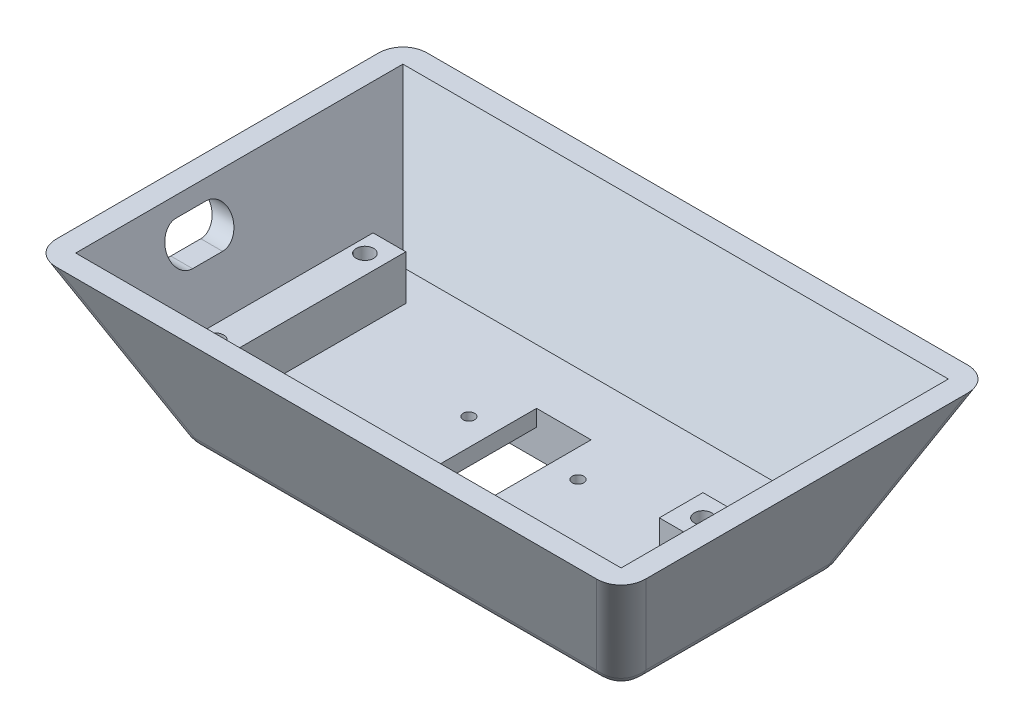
ISO-10303-21;
HEADER;
FILE_DESCRIPTION(('STEP AP214'),'2;1');
FILE_NAME('part.step','',(''),(''),'','','');
FILE_SCHEMA(('AUTOMOTIVE_DESIGN { 1 0 10303 214 1 1 1 1 }'));
ENDSEC;
DATA;
#1=APPLICATION_CONTEXT('core data for automotive mechanical design processes');
#2=APPLICATION_PROTOCOL_DEFINITION('international standard','automotive_design',2000,#1);
#3=PRODUCT_CONTEXT('',#1,'mechanical');
#4=PRODUCT('Part','Part','',(#3));
#5=PRODUCT_RELATED_PRODUCT_CATEGORY('part','',(#4));
#6=PRODUCT_DEFINITION_FORMATION('','',#4);
#7=PRODUCT_DEFINITION_CONTEXT('part definition',#1,'design');
#8=PRODUCT_DEFINITION('design','',#6,#7);
#9=PRODUCT_DEFINITION_SHAPE('','',#8);
#10=(LENGTH_UNIT() NAMED_UNIT(*) SI_UNIT(.MILLI.,.METRE.));
#11=(NAMED_UNIT(*) PLANE_ANGLE_UNIT() SI_UNIT($,.RADIAN.));
#12=(NAMED_UNIT(*) SI_UNIT($,.STERADIAN.) SOLID_ANGLE_UNIT());
#13=UNCERTAINTY_MEASURE_WITH_UNIT(LENGTH_MEASURE(1.E-05),#10,'distance_accuracy_value','');
#14=(GEOMETRIC_REPRESENTATION_CONTEXT(3) GLOBAL_UNCERTAINTY_ASSIGNED_CONTEXT((#13)) GLOBAL_UNIT_ASSIGNED_CONTEXT((#10,
#11,#12)) REPRESENTATION_CONTEXT('',''));
#15=CARTESIAN_POINT('',(0.,0.,0.));
#16=DIRECTION('',(0.,0.,1.));
#17=DIRECTION('',(1.,0.,0.));
#18=AXIS2_PLACEMENT_3D('',#15,#16,#17);
#19=CARTESIAN_POINT('',(0.,8.,0.));
#20=DIRECTION('',(0.,1.,0.));
#21=DIRECTION('',(0.,0.,1.));
#22=AXIS2_PLACEMENT_3D('',#19,#20,#21);
#23=PLANE('',#22);
#24=CARTESIAN_POINT('',(-10.,8.,-2.1));
#25=DIRECTION('',(0.,1.,0.));
#26=DIRECTION('',(0.,0.,1.));
#27=AXIS2_PLACEMENT_3D('',#24,#25,#26);
#28=CIRCLE('',#27,1.05);
#29=CARTESIAN_POINT('',(-10.,8.,-1.05));
#30=VERTEX_POINT('',#29);
#31=EDGE_CURVE('E385',#30,#30,#28,.F.);
#32=ORIENTED_EDGE('',*,*,#31,.T.);
#33=EDGE_LOOP('',(#32));
#34=FACE_BOUND('',#33,.T.);
#35=DIRECTION('',(0.,0.,-1.));
#36=VECTOR('',#35,1.);
#37=CARTESIAN_POINT('',(-5.1,8.,9.6));
#38=LINE('',#37,#36);
#39=CARTESIAN_POINT('',(-5.1,8.,9.6));
#40=VERTEX_POINT('',#39);
#41=CARTESIAN_POINT('',(-5.1,8.,-9.6));
#42=VERTEX_POINT('',#41);
#43=EDGE_CURVE('E407',#40,#42,#38,.T.);
#44=ORIENTED_EDGE('',*,*,#43,.T.);
#45=DIRECTION('',(1.,0.,0.));
#46=VECTOR('',#45,1.);
#47=CARTESIAN_POINT('',(4.9,8.,-9.6));
#48=LINE('',#47,#46);
#49=CARTESIAN_POINT('',(4.9,8.,-9.6));
#50=VERTEX_POINT('',#49);
#51=EDGE_CURVE('E389',#42,#50,#48,.T.);
#52=ORIENTED_EDGE('',*,*,#51,.T.);
#53=DIRECTION('',(0.,0.,1.));
#54=VECTOR('',#53,1.);
#55=CARTESIAN_POINT('',(4.9,8.,9.6));
#56=LINE('',#55,#54);
#57=CARTESIAN_POINT('',(4.9,8.,9.6));
#58=VERTEX_POINT('',#57);
#59=EDGE_CURVE('E388',#50,#58,#56,.T.);
#60=ORIENTED_EDGE('',*,*,#59,.T.);
#61=DIRECTION('',(-1.,0.,0.));
#62=VECTOR('',#61,1.);
#63=CARTESIAN_POINT('',(4.9,8.,9.6));
#64=LINE('',#63,#62);
#65=EDGE_CURVE('E410',#58,#40,#64,.T.);
#66=ORIENTED_EDGE('',*,*,#65,.T.);
#67=EDGE_LOOP('',(#44,#52,#60,#66));
#68=FACE_BOUND('',#67,.T.);
#69=CARTESIAN_POINT('',(10.,8.,-2.1));
#70=DIRECTION('',(0.,1.,0.));
#71=DIRECTION('',(0.,0.,1.));
#72=AXIS2_PLACEMENT_3D('',#69,#70,#71);
#73=CIRCLE('',#72,1.05);
#74=CARTESIAN_POINT('',(10.,8.,-1.05));
#75=VERTEX_POINT('',#74);
#76=EDGE_CURVE('E393',#75,#75,#73,.F.);
#77=ORIENTED_EDGE('',*,*,#76,.T.);
#78=EDGE_LOOP('',(#77));
#79=FACE_BOUND('',#78,.T.);
#80=DIRECTION('',(1.,0.,0.));
#81=VECTOR('',#80,1.);
#82=CARTESIAN_POINT('',(0.,8.,-3.26953873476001));
#83=LINE('',#82,#81);
#84=CARTESIAN_POINT('',(31.73046126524,8.,-3.26953873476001));
#85=VERTEX_POINT('',#84);
#86=CARTESIAN_POINT('',(39.73046126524,8.,-3.26953873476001));
#87=VERTEX_POINT('',#86);
#88=EDGE_CURVE('E320',#85,#87,#83,.T.);
#89=ORIENTED_EDGE('',*,*,#88,.T.);
#90=DIRECTION('',(0.,0.,-1.));
#91=VECTOR('',#90,1.);
#92=CARTESIAN_POINT('',(39.73046126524,8.,0.));
#93=LINE('',#92,#91);
#94=CARTESIAN_POINT('',(39.73046126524,8.,-19.73046126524));
#95=VERTEX_POINT('',#94);
#96=EDGE_CURVE('E446',#87,#95,#93,.T.);
#97=ORIENTED_EDGE('',*,*,#96,.T.);
#98=DIRECTION('',(-1.,0.,0.));
#99=VECTOR('',#98,1.);
#100=CARTESIAN_POINT('',(0.,8.,-19.73046126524));
#101=LINE('',#100,#99);
#102=CARTESIAN_POINT('',(-39.73046126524,8.,-19.73046126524));
#103=VERTEX_POINT('',#102);
#104=EDGE_CURVE('E429',#95,#103,#101,.T.);
#105=ORIENTED_EDGE('',*,*,#104,.T.);
#106=DIRECTION('',(0.,0.,1.));
#107=VECTOR('',#106,1.);
#108=CARTESIAN_POINT('',(-39.73046126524,8.,0.));
#109=LINE('',#108,#107);
#110=CARTESIAN_POINT('',(-39.73046126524,8.,-14.26953873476));
#111=VERTEX_POINT('',#110);
#112=EDGE_CURVE('E443',#103,#111,#109,.T.);
#113=ORIENTED_EDGE('',*,*,#112,.T.);
#114=DIRECTION('',(1.,0.,0.));
#115=VECTOR('',#114,1.);
#116=CARTESIAN_POINT('',(0.,8.,-14.26953873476));
#117=LINE('',#116,#115);
#118=CARTESIAN_POINT('',(-33.73046126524,8.,-14.26953873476));
#119=VERTEX_POINT('',#118);
#120=EDGE_CURVE('E354',#111,#119,#117,.T.);
#121=ORIENTED_EDGE('',*,*,#120,.T.);
#122=DIRECTION('',(0.,0.,1.));
#123=VECTOR('',#122,1.);
#124=CARTESIAN_POINT('',(-33.73046126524,8.,0.));
#125=LINE('',#124,#123);
#126=CARTESIAN_POINT('',(-33.73046126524,8.,19.73046126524));
#127=VERTEX_POINT('',#126);
#128=EDGE_CURVE('E349',#119,#127,#125,.T.);
#129=ORIENTED_EDGE('',*,*,#128,.T.);
#130=DIRECTION('',(1.,0.,0.));
#131=VECTOR('',#130,1.);
#132=CARTESIAN_POINT('',(0.,8.,19.73046126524));
#133=LINE('',#132,#131);
#134=CARTESIAN_POINT('',(39.73046126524,8.,19.73046126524));
#135=VERTEX_POINT('',#134);
#136=EDGE_CURVE('E450',#127,#135,#133,.T.);
#137=ORIENTED_EDGE('',*,*,#136,.T.);
#138=CARTESIAN_POINT('',(39.73046126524,8.,4.73046126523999));
#139=VERTEX_POINT('',#138);
#140=EDGE_CURVE('E438',#135,#139,#93,.T.);
#141=ORIENTED_EDGE('',*,*,#140,.T.);
#142=DIRECTION('',(-1.,0.,0.));
#143=VECTOR('',#142,1.);
#144=CARTESIAN_POINT('',(0.,8.,4.73046126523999));
#145=LINE('',#144,#143);
#146=CARTESIAN_POINT('',(31.73046126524,8.,4.73046126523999));
#147=VERTEX_POINT('',#146);
#148=EDGE_CURVE('E326',#139,#147,#145,.T.);
#149=ORIENTED_EDGE('',*,*,#148,.T.);
#150=DIRECTION('',(0.,0.,-1.));
#151=VECTOR('',#150,1.);
#152=CARTESIAN_POINT('',(31.73046126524,8.,0.));
#153=LINE('',#152,#151);
#154=EDGE_CURVE('E323',#147,#85,#153,.T.);
#155=ORIENTED_EDGE('',*,*,#154,.T.);
#156=EDGE_LOOP('',(#89,#97,#105,#113,#121,#129,#137,#141,#149,#155));
#157=FACE_BOUND('',#156,.T.);
#158=ADVANCED_FACE('F43',(#34,#68,#79,#157),#23,.T.);
#159=CARTESIAN_POINT('',(0.,5.,0.));
#160=DIRECTION('',(0.,-1.,0.));
#161=DIRECTION('',(0.,0.,-1.));
#162=AXIS2_PLACEMENT_3D('',#159,#160,#161);
#163=PLANE('',#162);
#164=DIRECTION('',(0.,0.,-1.));
#165=VECTOR('',#164,1.);
#166=CARTESIAN_POINT('',(-5.1,5.,9.6));
#167=LINE('',#166,#165);
#168=CARTESIAN_POINT('',(-5.1,5.,9.6));
#169=VERTEX_POINT('',#168);
#170=CARTESIAN_POINT('',(-5.1,5.,-9.6));
#171=VERTEX_POINT('',#170);
#172=EDGE_CURVE('E404',#169,#171,#167,.T.);
#173=ORIENTED_EDGE('',*,*,#172,.F.);
#174=DIRECTION('',(-1.,0.,0.));
#175=VECTOR('',#174,1.);
#176=CARTESIAN_POINT('',(-15.1,5.,9.6));
#177=LINE('',#176,#175);
#178=CARTESIAN_POINT('',(-15.1,5.,9.6));
#179=VERTEX_POINT('',#178);
#180=EDGE_CURVE('E456',#169,#179,#177,.T.);
#181=ORIENTED_EDGE('',*,*,#180,.T.);
#182=DIRECTION('',(0.,0.,-1.));
#183=VECTOR('',#182,1.);
#184=CARTESIAN_POINT('',(-15.1,5.,9.6));
#185=LINE('',#184,#183);
#186=CARTESIAN_POINT('',(-15.1,5.,-9.6));
#187=VERTEX_POINT('',#186);
#188=EDGE_CURVE('E461',#179,#187,#185,.T.);
#189=ORIENTED_EDGE('',*,*,#188,.T.);
#190=DIRECTION('',(1.,0.,0.));
#191=VECTOR('',#190,1.);
#192=CARTESIAN_POINT('',(-15.1,5.,-9.6));
#193=LINE('',#192,#191);
#194=EDGE_CURVE('E465',#187,#171,#193,.T.);
#195=ORIENTED_EDGE('',*,*,#194,.T.);
#196=EDGE_LOOP('',(#173,#181,#189,#195));
#197=FACE_BOUND('',#196,.T.);
#198=CARTESIAN_POINT('',(-10.,5.,-2.1));
#199=DIRECTION('',(0.,-1.,0.));
#200=DIRECTION('',(0.,0.,-1.));
#201=AXIS2_PLACEMENT_3D('',#198,#199,#200);
#202=CIRCLE('',#201,1.05);
#203=CARTESIAN_POINT('',(-10.,5.,-3.15));
#204=VERTEX_POINT('',#203);
#205=EDGE_CURVE('E381',#204,#204,#202,.T.);
#206=ORIENTED_EDGE('',*,*,#205,.F.);
#207=EDGE_LOOP('',(#206));
#208=FACE_BOUND('',#207,.T.);
#209=ADVANCED_FACE('F650',(#197,#208),#163,.T.);
#210=CARTESIAN_POINT('',(40.,0.,-20.));
#211=DIRECTION('',(0.90630778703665,-0.4226182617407,0.));
#212=DIRECTION('',(0.4226182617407,0.90630778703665,0.));
#213=AXIS2_PLACEMENT_3D('',#210,#211,#212);
#214=PLANE('',#213);
#215=DIRECTION('',(0.,0.,1.));
#216=VECTOR('',#215,1.);
#217=CARTESIAN_POINT('',(53.98922974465,30.,-20.));
#218=LINE('',#217,#216);
#219=CARTESIAN_POINT('',(53.98922974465,30.,29.4576908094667));
#220=VERTEX_POINT('',#219);
#221=CARTESIAN_POINT('',(53.98922974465,30.,-29.4576908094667));
#222=VERTEX_POINT('',#221);
#223=EDGE_CURVE('E480',#220,#222,#218,.F.);
#224=ORIENTED_EDGE('',*,*,#223,.F.);
#225=DIRECTION('',(0.389281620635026,0.834817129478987,0.389281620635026));
#226=VECTOR('',#225,1.);
#227=CARTESIAN_POINT('',(34.6251030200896,-11.5265037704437,10.0935640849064));
#228=LINE('',#227,#226);
#229=CARTESIAN_POINT('',(41.3461876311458,2.8869086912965,16.8146486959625));
#230=VERTEX_POINT('',#229);
#231=EDGE_CURVE('E533',#220,#230,#228,.F.);
#232=ORIENTED_EDGE('',*,*,#231,.T.);
#233=DIRECTION('',(0.,0.,-1.));
#234=VECTOR('',#233,1.);
#235=CARTESIAN_POINT('',(41.3461876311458,2.8869086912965,-20.));
#236=LINE('',#235,#234);
#237=CARTESIAN_POINT('',(41.3461876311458,2.8869086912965,-16.8146486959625));
#238=VERTEX_POINT('',#237);
#239=EDGE_CURVE('E531',#230,#238,#236,.T.);
#240=ORIENTED_EDGE('',*,*,#239,.T.);
#241=DIRECTION('',(0.389281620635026,0.834817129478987,-0.389281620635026));
#242=VECTOR('',#241,1.);
#243=CARTESIAN_POINT('',(40.6867102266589,1.4726548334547,-16.1551712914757));
#244=LINE('',#243,#242);
#245=EDGE_CURVE('E529',#238,#222,#244,.T.);
#246=ORIENTED_EDGE('',*,*,#245,.T.);
#247=EDGE_LOOP('',(#224,#232,#240,#246));
#248=FACE_BOUND('',#247,.T.);
#249=ADVANCED_FACE('F613',(#248),#214,.T.);
#250=CARTESIAN_POINT('',(-40.,0.,-20.));
#251=DIRECTION('',(0.,-0.4226182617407,-0.90630778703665));
#252=DIRECTION('',(0.,0.90630778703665,-0.4226182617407));
#253=AXIS2_PLACEMENT_3D('',#250,#251,#252);
#254=PLANE('',#253);
#255=DIRECTION('',(1.,0.,0.));
#256=VECTOR('',#255,1.);
#257=CARTESIAN_POINT('',(-40.,30.,-33.98922974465));
#258=LINE('',#257,#256);
#259=CARTESIAN_POINT('',(49.4576908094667,30.,-33.98922974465));
#260=VERTEX_POINT('',#259);
#261=CARTESIAN_POINT('',(-49.4576908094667,30.,-33.98922974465));
#262=VERTEX_POINT('',#261);
#263=EDGE_CURVE('E489',#260,#262,#258,.F.);
#264=ORIENTED_EDGE('',*,*,#263,.F.);
#265=DIRECTION('',(0.389281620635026,0.834817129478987,-0.389281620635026));
#266=VECTOR('',#265,1.);
#267=CARTESIAN_POINT('',(24.0319568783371,-24.5256623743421,-8.56349581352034));
#268=LINE('',#267,#266);
#269=CARTESIAN_POINT('',(36.8146486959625,2.8869086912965,-21.3461876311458));
#270=VERTEX_POINT('',#269);
#271=EDGE_CURVE('E60',#260,#270,#268,.F.);
#272=ORIENTED_EDGE('',*,*,#271,.T.);
#273=DIRECTION('',(-1.,0.,0.));
#274=VECTOR('',#273,1.);
#275=CARTESIAN_POINT('',(-40.,2.8869086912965,-21.3461876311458));
#276=LINE('',#275,#274);
#277=CARTESIAN_POINT('',(-36.8146486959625,2.8869086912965,-21.3461876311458));
#278=VERTEX_POINT('',#277);
#279=EDGE_CURVE('E65',#270,#278,#276,.T.);
#280=ORIENTED_EDGE('',*,*,#279,.T.);
#281=DIRECTION('',(-0.389281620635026,0.834817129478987,-0.389281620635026));
#282=VECTOR('',#281,1.);
#283=CARTESIAN_POINT('',(-36.1551712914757,1.4726548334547,-20.6867102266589));
#284=LINE('',#283,#282);
#285=EDGE_CURVE('E535',#278,#262,#284,.T.);
#286=ORIENTED_EDGE('',*,*,#285,.T.);
#287=EDGE_LOOP('',(#264,#272,#280,#286));
#288=FACE_BOUND('',#287,.T.);
#289=ADVANCED_FACE('F607',(#288),#254,.T.);
#290=CARTESIAN_POINT('',(-40.,0.,-20.));
#291=DIRECTION('',(-0.90630778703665,-0.4226182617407,0.));
#292=DIRECTION('',(0.4226182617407,-0.90630778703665,0.));
#293=AXIS2_PLACEMENT_3D('',#290,#291,#292);
#294=PLANE('',#293);
#295=DIRECTION('',(0.,0.,1.));
#296=VECTOR('',#295,1.);
#297=CARTESIAN_POINT('',(-52.8234605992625,27.5,12.75));
#298=LINE('',#297,#296);
#299=CARTESIAN_POINT('',(-52.8234605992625,27.5,12.75));
#300=VERTEX_POINT('',#299);
#301=CARTESIAN_POINT('',(-52.8234605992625,27.5,7.25000000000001));
#302=VERTEX_POINT('',#301);
#303=EDGE_CURVE('E297',#300,#302,#298,.F.);
#304=ORIENTED_EDGE('',*,*,#303,.F.);
#305=CARTESIAN_POINT('',(-51.3079607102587,24.25,12.75));
#306=DIRECTION('',(-0.90630778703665,-0.4226182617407,0.));
#307=DIRECTION('',(0.4226182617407,-0.90630778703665,0.));
#308=AXIS2_PLACEMENT_3D('',#305,#306,#307);
#309=ELLIPSE('',#308,3.5859782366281,3.25);
#310=CARTESIAN_POINT('',(-49.792460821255,21.,12.75));
#311=VERTEX_POINT('',#310);
#312=EDGE_CURVE('E300',#311,#300,#309,.T.);
#313=ORIENTED_EDGE('',*,*,#312,.F.);
#314=DIRECTION('',(0.,0.,-1.));
#315=VECTOR('',#314,1.);
#316=CARTESIAN_POINT('',(-49.792460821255,21.,12.75));
#317=LINE('',#316,#315);
#318=CARTESIAN_POINT('',(-49.792460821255,21.,7.25000000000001));
#319=VERTEX_POINT('',#318);
#320=EDGE_CURVE('E282',#319,#311,#317,.F.);
#321=ORIENTED_EDGE('',*,*,#320,.F.);
#322=CARTESIAN_POINT('',(-51.3079607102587,24.25,7.25000000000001));
#323=DIRECTION('',(-0.90630778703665,-0.4226182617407,0.));
#324=DIRECTION('',(0.4226182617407,-0.90630778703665,0.));
#325=AXIS2_PLACEMENT_3D('',#322,#323,#324);
#326=ELLIPSE('',#325,3.5859782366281,3.25);
#327=EDGE_CURVE('E269',#302,#319,#326,.T.);
#328=ORIENTED_EDGE('',*,*,#327,.F.);
#329=EDGE_LOOP('',(#304,#313,#321,#328));
#330=FACE_BOUND('',#329,.T.);
#331=DIRECTION('',(0.,0.,1.));
#332=VECTOR('',#331,1.);
#333=CARTESIAN_POINT('',(-41.3461876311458,2.8869086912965,-20.));
#334=LINE('',#333,#332);
#335=CARTESIAN_POINT('',(-41.3461876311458,2.8869086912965,-16.8146486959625));
#336=VERTEX_POINT('',#335);
#337=CARTESIAN_POINT('',(-41.3461876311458,2.8869086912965,16.8146486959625));
#338=VERTEX_POINT('',#337);
#339=EDGE_CURVE('E509',#336,#338,#334,.T.);
#340=ORIENTED_EDGE('',*,*,#339,.T.);
#341=DIRECTION('',(-0.389281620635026,0.834817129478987,0.389281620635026));
#342=VECTOR('',#341,1.);
#343=CARTESIAN_POINT('',(-34.6251030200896,-11.5265037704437,10.0935640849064));
#344=LINE('',#343,#342);
#345=CARTESIAN_POINT('',(-53.98922974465,30.,29.4576908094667));
#346=VERTEX_POINT('',#345);
#347=EDGE_CURVE('E512',#338,#346,#344,.T.);
#348=ORIENTED_EDGE('',*,*,#347,.T.);
#349=DIRECTION('',(0.,0.,-1.));
#350=VECTOR('',#349,1.);
#351=CARTESIAN_POINT('',(-53.98922974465,30.,-20.));
#352=LINE('',#351,#350);
#353=CARTESIAN_POINT('',(-53.98922974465,30.,-29.4576908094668));
#354=VERTEX_POINT('',#353);
#355=EDGE_CURVE('E492',#354,#346,#352,.F.);
#356=ORIENTED_EDGE('',*,*,#355,.F.);
#357=DIRECTION('',(-0.389281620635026,0.834817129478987,-0.389281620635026));
#358=VECTOR('',#357,1.);
#359=CARTESIAN_POINT('',(-40.6867102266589,1.4726548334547,-16.1551712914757));
#360=LINE('',#359,#358);
#361=EDGE_CURVE('E507',#354,#336,#360,.F.);
#362=ORIENTED_EDGE('',*,*,#361,.T.);
#363=EDGE_LOOP('',(#340,#348,#356,#362));
#364=FACE_BOUND('',#363,.T.);
#365=ADVANCED_FACE('F634',(#330,#364),#294,.T.);
#366=CARTESIAN_POINT('',(-40.,0.,20.));
#367=DIRECTION('',(0.,-0.4226182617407,0.90630778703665));
#368=DIRECTION('',(0.,-0.90630778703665,-0.4226182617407));
#369=AXIS2_PLACEMENT_3D('',#366,#367,#368);
#370=PLANE('',#369);
#371=DIRECTION('',(-1.,0.,0.));
#372=VECTOR('',#371,1.);
#373=CARTESIAN_POINT('',(-40.,30.,33.98922974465));
#374=LINE('',#373,#372);
#375=CARTESIAN_POINT('',(-49.4576908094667,30.,33.98922974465));
#376=VERTEX_POINT('',#375);
#377=CARTESIAN_POINT('',(49.4576908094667,30.,33.98922974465));
#378=VERTEX_POINT('',#377);
#379=EDGE_CURVE('E495',#376,#378,#374,.F.);
#380=ORIENTED_EDGE('',*,*,#379,.F.);
#381=DIRECTION('',(-0.389281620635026,0.834817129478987,0.389281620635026));
#382=VECTOR('',#381,1.);
#383=CARTESIAN_POINT('',(-36.1551712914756,1.4726548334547,20.6867102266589));
#384=LINE('',#383,#382);
#385=CARTESIAN_POINT('',(-36.8146486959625,2.8869086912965,21.3461876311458));
#386=VERTEX_POINT('',#385);
#387=EDGE_CURVE('E527',#376,#386,#384,.F.);
#388=ORIENTED_EDGE('',*,*,#387,.T.);
#389=DIRECTION('',(1.,0.,0.));
#390=VECTOR('',#389,1.);
#391=CARTESIAN_POINT('',(-40.,2.8869086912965,21.3461876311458));
#392=LINE('',#391,#390);
#393=CARTESIAN_POINT('',(36.8146486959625,2.8869086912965,21.3461876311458));
#394=VERTEX_POINT('',#393);
#395=EDGE_CURVE('E525',#386,#394,#392,.T.);
#396=ORIENTED_EDGE('',*,*,#395,.T.);
#397=DIRECTION('',(0.389281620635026,0.834817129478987,0.389281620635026));
#398=VECTOR('',#397,1.);
#399=CARTESIAN_POINT('',(24.0319568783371,-24.5256623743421,8.56349581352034));
#400=LINE('',#399,#398);
#401=EDGE_CURVE('E523',#394,#378,#400,.T.);
#402=ORIENTED_EDGE('',*,*,#401,.T.);
#403=EDGE_LOOP('',(#380,#388,#396,#402));
#404=FACE_BOUND('',#403,.T.);
#405=ADVANCED_FACE('F637',(#404),#370,.T.);
#406=CARTESIAN_POINT('',(0.,30.,0.));
#407=DIRECTION('',(0.,1.,0.));
#408=DIRECTION('',(0.,0.,1.));
#409=AXIS2_PLACEMENT_3D('',#406,#407,#408);
#410=PLANE('',#409);
#411=DIRECTION('',(-1.,0.,0.));
#412=VECTOR('',#411,1.);
#413=CARTESIAN_POINT('',(49.98922974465,30.,-29.98922974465));
#414=LINE('',#413,#412);
#415=CARTESIAN_POINT('',(49.98922974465,30.,-29.98922974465));
#416=VERTEX_POINT('',#415);
#417=CARTESIAN_POINT('',(-49.98922974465,30.,-29.98922974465));
#418=VERTEX_POINT('',#417);
#419=EDGE_CURVE('E384',#416,#418,#414,.T.);
#420=ORIENTED_EDGE('',*,*,#419,.F.);
#421=DIRECTION('',(0.,0.,-1.));
#422=VECTOR('',#421,1.);
#423=CARTESIAN_POINT('',(49.98922974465,30.,29.98922974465));
#424=LINE('',#423,#422);
#425=CARTESIAN_POINT('',(49.98922974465,30.,29.98922974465));
#426=VERTEX_POINT('',#425);
#427=EDGE_CURVE('E426',#426,#416,#424,.T.);
#428=ORIENTED_EDGE('',*,*,#427,.F.);
#429=DIRECTION('',(1.,0.,0.));
#430=VECTOR('',#429,1.);
#431=CARTESIAN_POINT('',(-49.98922974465,30.,29.98922974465));
#432=LINE('',#431,#430);
#433=CARTESIAN_POINT('',(-49.98922974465,30.,29.98922974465));
#434=VERTEX_POINT('',#433);
#435=EDGE_CURVE('E423',#434,#426,#432,.T.);
#436=ORIENTED_EDGE('',*,*,#435,.F.);
#437=DIRECTION('',(0.,0.,1.));
#438=VECTOR('',#437,1.);
#439=CARTESIAN_POINT('',(-49.98922974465,30.,-29.98922974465));
#440=LINE('',#439,#438);
#441=EDGE_CURVE('E420',#418,#434,#440,.T.);
#442=ORIENTED_EDGE('',*,*,#441,.F.);
#443=EDGE_LOOP('',(#420,#428,#436,#442));
#444=FACE_BOUND('',#443,.T.);
#445=ORIENTED_EDGE('',*,*,#355,.T.);
#446=CARTESIAN_POINT('',(-48.4723401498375,30.,28.4723401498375));
#447=DIRECTION('',(0.,1.,0.));
#448=DIRECTION('',(0.707106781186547,0.,-0.707106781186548));
#449=AXIS2_PLACEMENT_3D('',#446,#447,#448);
#450=ELLIPSE('',#449,5.98933565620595,5.);
#451=EDGE_CURVE('E11',#346,#376,#450,.T.);
#452=ORIENTED_EDGE('',*,*,#451,.T.);
#453=ORIENTED_EDGE('',*,*,#379,.T.);
#454=CARTESIAN_POINT('',(48.4723401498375,30.,28.4723401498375));
#455=DIRECTION('',(0.,1.,0.));
#456=DIRECTION('',(-0.707106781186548,0.,-0.707106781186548));
#457=AXIS2_PLACEMENT_3D('',#454,#455,#456);
#458=ELLIPSE('',#457,5.98933565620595,5.);
#459=EDGE_CURVE('E52',#378,#220,#458,.T.);
#460=ORIENTED_EDGE('',*,*,#459,.T.);
#461=ORIENTED_EDGE('',*,*,#223,.T.);
#462=CARTESIAN_POINT('',(48.4723401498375,30.,-28.4723401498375));
#463=DIRECTION('',(0.,1.,0.));
#464=DIRECTION('',(-0.707106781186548,0.,0.707106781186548));
#465=AXIS2_PLACEMENT_3D('',#462,#463,#464);
#466=ELLIPSE('',#465,5.98933565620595,5.);
#467=EDGE_CURVE('E541',#222,#260,#466,.T.);
#468=ORIENTED_EDGE('',*,*,#467,.T.);
#469=ORIENTED_EDGE('',*,*,#263,.T.);
#470=CARTESIAN_POINT('',(-48.4723401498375,30.,-28.4723401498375));
#471=DIRECTION('',(0.,1.,0.));
#472=DIRECTION('',(0.707106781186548,0.,0.707106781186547));
#473=AXIS2_PLACEMENT_3D('',#470,#471,#472);
#474=ELLIPSE('',#473,5.98933565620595,5.);
#475=EDGE_CURVE('E539',#262,#354,#474,.T.);
#476=ORIENTED_EDGE('',*,*,#475,.T.);
#477=EDGE_LOOP('',(#445,#452,#453,#460,#461,#468,#469,#476));
#478=FACE_BOUND('',#477,.T.);
#479=ADVANCED_FACE('F609',(#444,#478),#410,.T.);
#480=CARTESIAN_POINT('',(0.,0.,0.));
#481=DIRECTION('',(0.,1.,0.));
#482=DIRECTION('',(0.,0.,1.));
#483=AXIS2_PLACEMENT_3D('',#480,#481,#482);
#484=PLANE('',#483);
#485=DIRECTION('',(-1.,0.,0.));
#486=VECTOR('',#485,1.);
#487=CARTESIAN_POINT('',(0.,0.,16.8146486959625));
#488=LINE('',#487,#486);
#489=CARTESIAN_POINT('',(36.8146486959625,0.,16.8146486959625));
#490=VERTEX_POINT('',#489);
#491=CARTESIAN_POINT('',(-36.8146486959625,0.,16.8146486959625));
#492=VERTEX_POINT('',#491);
#493=EDGE_CURVE('E518',#490,#492,#488,.T.);
#494=ORIENTED_EDGE('',*,*,#493,.T.);
#495=DIRECTION('',(0.,0.,-1.));
#496=VECTOR('',#495,1.);
#497=CARTESIAN_POINT('',(-36.8146486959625,0.,0.));
#498=LINE('',#497,#496);
#499=CARTESIAN_POINT('',(-36.8146486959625,0.,-16.8146486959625));
#500=VERTEX_POINT('',#499);
#501=EDGE_CURVE('E520',#492,#500,#498,.T.);
#502=ORIENTED_EDGE('',*,*,#501,.T.);
#503=DIRECTION('',(1.,0.,0.));
#504=VECTOR('',#503,1.);
#505=CARTESIAN_POINT('',(0.,0.,-16.8146486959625));
#506=LINE('',#505,#504);
#507=CARTESIAN_POINT('',(36.8146486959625,0.,-16.8146486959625));
#508=VERTEX_POINT('',#507);
#509=EDGE_CURVE('E514',#500,#508,#506,.T.);
#510=ORIENTED_EDGE('',*,*,#509,.T.);
#511=DIRECTION('',(0.,0.,1.));
#512=VECTOR('',#511,1.);
#513=CARTESIAN_POINT('',(36.8146486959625,0.,0.));
#514=LINE('',#513,#512);
#515=EDGE_CURVE('E516',#508,#490,#514,.T.);
#516=ORIENTED_EDGE('',*,*,#515,.T.);
#517=EDGE_LOOP('',(#494,#502,#510,#516));
#518=FACE_BOUND('',#517,.T.);
#519=DIRECTION('',(-1.,0.,0.));
#520=VECTOR('',#519,1.);
#521=CARTESIAN_POINT('',(-15.1,0.,9.6));
#522=LINE('',#521,#520);
#523=CARTESIAN_POINT('',(15.1,0.,9.6));
#524=VERTEX_POINT('',#523);
#525=CARTESIAN_POINT('',(-15.1,0.,9.6));
#526=VERTEX_POINT('',#525);
#527=EDGE_CURVE('E470',#524,#526,#522,.T.);
#528=ORIENTED_EDGE('',*,*,#527,.F.);
#529=DIRECTION('',(0.,0.,1.));
#530=VECTOR('',#529,1.);
#531=CARTESIAN_POINT('',(15.1,0.,9.6));
#532=LINE('',#531,#530);
#533=CARTESIAN_POINT('',(15.1,0.,-9.6));
#534=VERTEX_POINT('',#533);
#535=EDGE_CURVE('E432',#534,#524,#532,.T.);
#536=ORIENTED_EDGE('',*,*,#535,.F.);
#537=DIRECTION('',(1.,0.,0.));
#538=VECTOR('',#537,1.);
#539=CARTESIAN_POINT('',(-15.1,0.,-9.6));
#540=LINE('',#539,#538);
#541=CARTESIAN_POINT('',(-15.1,0.,-9.6));
#542=VERTEX_POINT('',#541);
#543=EDGE_CURVE('E457',#542,#534,#540,.T.);
#544=ORIENTED_EDGE('',*,*,#543,.F.);
#545=DIRECTION('',(0.,0.,-1.));
#546=VECTOR('',#545,1.);
#547=CARTESIAN_POINT('',(-15.1,0.,9.6));
#548=LINE('',#547,#546);
#549=EDGE_CURVE('E473',#526,#542,#548,.T.);
#550=ORIENTED_EDGE('',*,*,#549,.F.);
#551=EDGE_LOOP('',(#528,#536,#544,#550));
#552=FACE_BOUND('',#551,.T.);
#553=ADVANCED_FACE('F589',(#518,#552),#484,.F.);
#554=CARTESIAN_POINT('',(15.1,5.,9.6));
#555=DIRECTION('',(1.,0.,0.));
#556=DIRECTION('',(0.,0.,-1.));
#557=AXIS2_PLACEMENT_3D('',#554,#555,#556);
#558=PLANE('',#557);
#559=ORIENTED_EDGE('',*,*,#535,.T.);
#560=DIRECTION('',(0.,-1.,0.));
#561=VECTOR('',#560,1.);
#562=CARTESIAN_POINT('',(15.1,5.,9.6));
#563=LINE('',#562,#561);
#564=CARTESIAN_POINT('',(15.1,5.,9.6));
#565=VERTEX_POINT('',#564);
#566=EDGE_CURVE('E468',#565,#524,#563,.T.);
#567=ORIENTED_EDGE('',*,*,#566,.F.);
#568=DIRECTION('',(0.,0.,1.));
#569=VECTOR('',#568,1.);
#570=CARTESIAN_POINT('',(15.1,5.,9.6));
#571=LINE('',#570,#569);
#572=CARTESIAN_POINT('',(15.1,5.,-9.6));
#573=VERTEX_POINT('',#572);
#574=EDGE_CURVE('E453',#573,#565,#571,.T.);
#575=ORIENTED_EDGE('',*,*,#574,.F.);
#576=DIRECTION('',(0.,-1.,0.));
#577=VECTOR('',#576,1.);
#578=CARTESIAN_POINT('',(15.1,5.,-9.6));
#579=LINE('',#578,#577);
#580=EDGE_CURVE('E478',#573,#534,#579,.T.);
#581=ORIENTED_EDGE('',*,*,#580,.T.);
#582=EDGE_LOOP('',(#559,#567,#575,#581));
#583=FACE_BOUND('',#582,.T.);
#584=ADVANCED_FACE('F754',(#583),#558,.F.);
#585=CARTESIAN_POINT('',(-15.1,5.,-9.6));
#586=DIRECTION('',(0.,0.,-1.));
#587=DIRECTION('',(-1.,0.,0.));
#588=AXIS2_PLACEMENT_3D('',#585,#586,#587);
#589=PLANE('',#588);
#590=ORIENTED_EDGE('',*,*,#543,.T.);
#591=ORIENTED_EDGE('',*,*,#580,.F.);
#592=CARTESIAN_POINT('',(4.9,5.,-9.6));
#593=VERTEX_POINT('',#592);
#594=EDGE_CURVE('E464',#593,#573,#193,.T.);
#595=ORIENTED_EDGE('',*,*,#594,.F.);
#596=DIRECTION('',(0.,-1.,0.));
#597=VECTOR('',#596,1.);
#598=CARTESIAN_POINT('',(4.9,30.001,-9.6));
#599=LINE('',#598,#597);
#600=EDGE_CURVE('E397',#50,#593,#599,.T.);
#601=ORIENTED_EDGE('',*,*,#600,.F.);
#602=ORIENTED_EDGE('',*,*,#51,.F.);
#603=DIRECTION('',(0.,-1.,0.));
#604=VECTOR('',#603,1.);
#605=CARTESIAN_POINT('',(-5.1,30.001,-9.6));
#606=LINE('',#605,#604);
#607=EDGE_CURVE('E394',#42,#171,#606,.T.);
#608=ORIENTED_EDGE('',*,*,#607,.T.);
#609=ORIENTED_EDGE('',*,*,#194,.F.);
#610=DIRECTION('',(0.,-1.,0.));
#611=VECTOR('',#610,1.);
#612=CARTESIAN_POINT('',(-15.1,5.,-9.6));
#613=LINE('',#612,#611);
#614=EDGE_CURVE('E481',#187,#542,#613,.T.);
#615=ORIENTED_EDGE('',*,*,#614,.T.);
#616=EDGE_LOOP('',(#590,#591,#595,#601,#602,#608,#609,#615));
#617=FACE_BOUND('',#616,.T.);
#618=ADVANCED_FACE('F751',(#617),#589,.F.);
#619=CARTESIAN_POINT('',(-15.1,5.,9.6));
#620=DIRECTION('',(-1.,0.,0.));
#621=DIRECTION('',(0.,0.,1.));
#622=AXIS2_PLACEMENT_3D('',#619,#620,#621);
#623=PLANE('',#622);
#624=ORIENTED_EDGE('',*,*,#549,.T.);
#625=ORIENTED_EDGE('',*,*,#614,.F.);
#626=ORIENTED_EDGE('',*,*,#188,.F.);
#627=DIRECTION('',(0.,-1.,0.));
#628=VECTOR('',#627,1.);
#629=CARTESIAN_POINT('',(-15.1,5.,9.6));
#630=LINE('',#629,#628);
#631=EDGE_CURVE('E483',#179,#526,#630,.T.);
#632=ORIENTED_EDGE('',*,*,#631,.T.);
#633=EDGE_LOOP('',(#624,#625,#626,#632));
#634=FACE_BOUND('',#633,.T.);
#635=ADVANCED_FACE('F744',(#634),#623,.F.);
#636=CARTESIAN_POINT('',(-15.1,5.,9.6));
#637=DIRECTION('',(0.,0.,1.));
#638=DIRECTION('',(1.,0.,0.));
#639=AXIS2_PLACEMENT_3D('',#636,#637,#638);
#640=PLANE('',#639);
#641=ORIENTED_EDGE('',*,*,#527,.T.);
#642=ORIENTED_EDGE('',*,*,#631,.F.);
#643=ORIENTED_EDGE('',*,*,#180,.F.);
#644=DIRECTION('',(0.,-1.,0.));
#645=VECTOR('',#644,1.);
#646=CARTESIAN_POINT('',(-5.1,30.001,9.6));
#647=LINE('',#646,#645);
#648=EDGE_CURVE('E392',#40,#169,#647,.T.);
#649=ORIENTED_EDGE('',*,*,#648,.F.);
#650=ORIENTED_EDGE('',*,*,#65,.F.);
#651=DIRECTION('',(0.,-1.,0.));
#652=VECTOR('',#651,1.);
#653=CARTESIAN_POINT('',(4.9,30.001,9.6));
#654=LINE('',#653,#652);
#655=CARTESIAN_POINT('',(4.9,5.,9.6));
#656=VERTEX_POINT('',#655);
#657=EDGE_CURVE('E399',#58,#656,#654,.T.);
#658=ORIENTED_EDGE('',*,*,#657,.T.);
#659=EDGE_CURVE('E458',#565,#656,#177,.T.);
#660=ORIENTED_EDGE('',*,*,#659,.F.);
#661=ORIENTED_EDGE('',*,*,#566,.T.);
#662=EDGE_LOOP('',(#641,#642,#643,#649,#650,#658,#660,#661));
#663=FACE_BOUND('',#662,.T.);
#664=ADVANCED_FACE('F736',(#663),#640,.F.);
#665=DIRECTION('',(0.,0.,1.));
#666=VECTOR('',#665,1.);
#667=CARTESIAN_POINT('',(4.9,5.,9.6));
#668=LINE('',#667,#666);
#669=EDGE_CURVE('E396',#593,#656,#668,.T.);
#670=ORIENTED_EDGE('',*,*,#669,.F.);
#671=ORIENTED_EDGE('',*,*,#594,.T.);
#672=ORIENTED_EDGE('',*,*,#574,.T.);
#673=ORIENTED_EDGE('',*,*,#659,.T.);
#674=EDGE_LOOP('',(#670,#671,#672,#673));
#675=FACE_BOUND('',#674,.T.);
#676=CARTESIAN_POINT('',(10.,5.,-2.1));
#677=DIRECTION('',(0.,-1.,0.));
#678=DIRECTION('',(0.,0.,1.));
#679=AXIS2_PLACEMENT_3D('',#676,#677,#678);
#680=CIRCLE('',#679,1.05);
#681=CARTESIAN_POINT('',(10.,5.,-1.05));
#682=VERTEX_POINT('',#681);
#683=EDGE_CURVE('E372',#682,#682,#680,.T.);
#684=ORIENTED_EDGE('',*,*,#683,.F.);
#685=EDGE_LOOP('',(#684));
#686=FACE_BOUND('',#685,.T.);
#687=ADVANCED_FACE('F660',(#675,#686),#163,.T.);
#688=CARTESIAN_POINT('',(49.98922974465,30.,-29.98922974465));
#689=DIRECTION('',(0.,-0.4226182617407,-0.90630778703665));
#690=DIRECTION('',(0.,0.90630778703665,-0.4226182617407));
#691=AXIS2_PLACEMENT_3D('',#688,#689,#690);
#692=PLANE('',#691);
#693=ORIENTED_EDGE('',*,*,#419,.T.);
#694=DIRECTION('',(-0.389281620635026,0.834817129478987,-0.389281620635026));
#695=VECTOR('',#694,1.);
#696=CARTESIAN_POINT('',(-34.8384759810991,-2.49089629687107,-14.8384759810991));
#697=LINE('',#696,#695);
#698=EDGE_CURVE('E434',#103,#418,#697,.T.);
#699=ORIENTED_EDGE('',*,*,#698,.F.);
#700=ORIENTED_EDGE('',*,*,#104,.F.);
#701=DIRECTION('',(0.389281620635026,0.834817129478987,-0.389281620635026));
#702=VECTOR('',#701,1.);
#703=CARTESIAN_POINT('',(40.9000831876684,10.5082623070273,-20.9000831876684));
#704=LINE('',#703,#702);
#705=EDGE_CURVE('E430',#95,#416,#704,.T.);
#706=ORIENTED_EDGE('',*,*,#705,.T.);
#707=EDGE_LOOP('',(#693,#699,#700,#706));
#708=FACE_BOUND('',#707,.T.);
#709=ADVANCED_FACE('F735',(#708),#692,.F.);
#710=CARTESIAN_POINT('',(49.98922974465,30.,29.98922974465));
#711=DIRECTION('',(0.90630778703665,-0.4226182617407,0.));
#712=DIRECTION('',(0.4226182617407,0.90630778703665,0.));
#713=AXIS2_PLACEMENT_3D('',#710,#711,#712);
#714=PLANE('',#713);
#715=ORIENTED_EDGE('',*,*,#427,.T.);
#716=ORIENTED_EDGE('',*,*,#705,.F.);
#717=ORIENTED_EDGE('',*,*,#96,.F.);
#718=DIRECTION('',(0.,0.,1.));
#719=VECTOR('',#718,1.);
#720=CARTESIAN_POINT('',(39.73046126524,8.,0.));
#721=LINE('',#720,#719);
#722=EDGE_CURVE('E328',#87,#139,#721,.T.);
#723=ORIENTED_EDGE('',*,*,#722,.T.);
#724=ORIENTED_EDGE('',*,*,#140,.F.);
#725=DIRECTION('',(0.389281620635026,0.834817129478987,0.389281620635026));
#726=VECTOR('',#725,1.);
#727=CARTESIAN_POINT('',(34.8384759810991,-2.49089629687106,14.8384759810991));
#728=LINE('',#727,#726);
#729=EDGE_CURVE('E433',#135,#426,#728,.T.);
#730=ORIENTED_EDGE('',*,*,#729,.T.);
#731=EDGE_LOOP('',(#715,#716,#717,#723,#724,#730));
#732=FACE_BOUND('',#731,.T.);
#733=ADVANCED_FACE('F742',(#732),#714,.F.);
#734=CARTESIAN_POINT('',(-49.98922974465,30.,29.98922974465));
#735=DIRECTION('',(0.,-0.4226182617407,0.90630778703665));
#736=DIRECTION('',(0.,-0.90630778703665,-0.4226182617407));
#737=AXIS2_PLACEMENT_3D('',#734,#735,#736);
#738=PLANE('',#737);
#739=ORIENTED_EDGE('',*,*,#435,.T.);
#740=ORIENTED_EDGE('',*,*,#729,.F.);
#741=ORIENTED_EDGE('',*,*,#136,.F.);
#742=CARTESIAN_POINT('',(-39.73046126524,8.,19.73046126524));
#743=VERTEX_POINT('',#742);
#744=EDGE_CURVE('E447',#743,#127,#133,.T.);
#745=ORIENTED_EDGE('',*,*,#744,.F.);
#746=DIRECTION('',(-0.389281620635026,0.834817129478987,0.389281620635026));
#747=VECTOR('',#746,1.);
#748=CARTESIAN_POINT('',(-40.9000831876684,10.5082623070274,20.9000831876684));
#749=LINE('',#748,#747);
#750=EDGE_CURVE('E437',#743,#434,#749,.T.);
#751=ORIENTED_EDGE('',*,*,#750,.T.);
#752=EDGE_LOOP('',(#739,#740,#741,#745,#751));
#753=FACE_BOUND('',#752,.T.);
#754=ADVANCED_FACE('F728',(#753),#738,.F.);
#755=CARTESIAN_POINT('',(-49.98922974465,30.,-29.98922974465));
#756=DIRECTION('',(-0.90630778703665,-0.4226182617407,0.));
#757=DIRECTION('',(0.4226182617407,-0.90630778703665,0.));
#758=AXIS2_PLACEMENT_3D('',#755,#756,#757);
#759=PLANE('',#758);
#760=DIRECTION('',(0.,0.,-1.));
#761=VECTOR('',#760,1.);
#762=CARTESIAN_POINT('',(-45.792460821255,21.,12.75));
#763=LINE('',#762,#761);
#764=CARTESIAN_POINT('',(-45.792460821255,21.,12.75));
#765=VERTEX_POINT('',#764);
#766=CARTESIAN_POINT('',(-45.792460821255,21.,7.25000000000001));
#767=VERTEX_POINT('',#766);
#768=EDGE_CURVE('E278',#765,#767,#763,.T.);
#769=ORIENTED_EDGE('',*,*,#768,.F.);
#770=CARTESIAN_POINT('',(-47.3079607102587,24.25,12.75));
#771=DIRECTION('',(-0.90630778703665,-0.4226182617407,0.));
#772=DIRECTION('',(0.4226182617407,-0.90630778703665,0.));
#773=AXIS2_PLACEMENT_3D('',#770,#771,#772);
#774=ELLIPSE('',#773,3.5859782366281,3.25);
#775=CARTESIAN_POINT('',(-48.8234605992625,27.5,12.75));
#776=VERTEX_POINT('',#775);
#777=EDGE_CURVE('E290',#776,#765,#774,.F.);
#778=ORIENTED_EDGE('',*,*,#777,.F.);
#779=DIRECTION('',(0.,0.,1.));
#780=VECTOR('',#779,1.);
#781=CARTESIAN_POINT('',(-48.8234605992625,27.5,12.75));
#782=LINE('',#781,#780);
#783=CARTESIAN_POINT('',(-48.8234605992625,27.5,7.25000000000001));
#784=VERTEX_POINT('',#783);
#785=EDGE_CURVE('E288',#784,#776,#782,.T.);
#786=ORIENTED_EDGE('',*,*,#785,.F.);
#787=CARTESIAN_POINT('',(-47.3079607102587,24.25,7.25000000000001));
#788=DIRECTION('',(-0.90630778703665,-0.4226182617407,0.));
#789=DIRECTION('',(0.4226182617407,-0.90630778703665,0.));
#790=AXIS2_PLACEMENT_3D('',#787,#788,#789);
#791=ELLIPSE('',#790,3.5859782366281,3.25);
#792=EDGE_CURVE('E266',#767,#784,#791,.F.);
#793=ORIENTED_EDGE('',*,*,#792,.F.);
#794=EDGE_LOOP('',(#769,#778,#786,#793));
#795=FACE_BOUND('',#794,.T.);
#796=ORIENTED_EDGE('',*,*,#441,.T.);
#797=ORIENTED_EDGE('',*,*,#750,.F.);
#798=DIRECTION('',(0.,0.,-1.));
#799=VECTOR('',#798,1.);
#800=CARTESIAN_POINT('',(-39.73046126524,8.,0.));
#801=LINE('',#800,#799);
#802=EDGE_CURVE('E366',#743,#111,#801,.T.);
#803=ORIENTED_EDGE('',*,*,#802,.T.);
#804=ORIENTED_EDGE('',*,*,#112,.F.);
#805=ORIENTED_EDGE('',*,*,#698,.T.);
#806=EDGE_LOOP('',(#796,#797,#803,#804,#805));
#807=FACE_BOUND('',#806,.T.);
#808=ADVANCED_FACE('F285',(#795,#807),#759,.F.);
#809=CARTESIAN_POINT('',(10.,30.001,-2.1));
#810=DIRECTION('',(0.,-1.,0.));
#811=DIRECTION('',(0.,0.,-1.));
#812=AXIS2_PLACEMENT_3D('',#809,#810,#811);
#813=CYLINDRICAL_SURFACE('',#812,1.05);
#814=ORIENTED_EDGE('',*,*,#76,.F.);
#815=EDGE_LOOP('',(#814));
#816=FACE_BOUND('',#815,.T.);
#817=ORIENTED_EDGE('',*,*,#683,.T.);
#818=EDGE_LOOP('',(#817));
#819=FACE_BOUND('',#818,.T.);
#820=ADVANCED_FACE('F719',(#816,#819),#813,.F.);
#821=CARTESIAN_POINT('',(-5.1,30.001,9.6));
#822=DIRECTION('',(-1.,0.,0.));
#823=DIRECTION('',(0.,0.,1.));
#824=AXIS2_PLACEMENT_3D('',#821,#822,#823);
#825=PLANE('',#824);
#826=ORIENTED_EDGE('',*,*,#648,.T.);
#827=ORIENTED_EDGE('',*,*,#172,.T.);
#828=ORIENTED_EDGE('',*,*,#607,.F.);
#829=ORIENTED_EDGE('',*,*,#43,.F.);
#830=EDGE_LOOP('',(#826,#827,#828,#829));
#831=FACE_BOUND('',#830,.T.);
#832=ADVANCED_FACE('F716',(#831),#825,.F.);
#833=CARTESIAN_POINT('',(4.9,30.001,9.6));
#834=DIRECTION('',(1.,0.,0.));
#835=DIRECTION('',(0.,0.,-1.));
#836=AXIS2_PLACEMENT_3D('',#833,#834,#835);
#837=PLANE('',#836);
#838=ORIENTED_EDGE('',*,*,#600,.T.);
#839=ORIENTED_EDGE('',*,*,#669,.T.);
#840=ORIENTED_EDGE('',*,*,#657,.F.);
#841=ORIENTED_EDGE('',*,*,#59,.F.);
#842=EDGE_LOOP('',(#838,#839,#840,#841));
#843=FACE_BOUND('',#842,.T.);
#844=ADVANCED_FACE('F714',(#843),#837,.F.);
#845=CARTESIAN_POINT('',(-10.,30.001,-2.1));
#846=DIRECTION('',(0.,-1.,0.));
#847=DIRECTION('',(0.,0.,-1.));
#848=AXIS2_PLACEMENT_3D('',#845,#846,#847);
#849=CYLINDRICAL_SURFACE('',#848,1.05);
#850=ORIENTED_EDGE('',*,*,#31,.F.);
#851=EDGE_LOOP('',(#850));
#852=FACE_BOUND('',#851,.T.);
#853=ORIENTED_EDGE('',*,*,#205,.T.);
#854=EDGE_LOOP('',(#853));
#855=FACE_BOUND('',#854,.T.);
#856=ADVANCED_FACE('F696',(#852,#855),#849,.F.);
#857=CARTESIAN_POINT('',(0.,16.2,0.));
#858=DIRECTION('',(0.,-1.,0.));
#859=DIRECTION('',(0.,0.,-1.));
#860=AXIS2_PLACEMENT_3D('',#857,#858,#859);
#861=PLANE('',#860);
#862=DIRECTION('',(0.,0.,1.));
#863=VECTOR('',#862,1.);
#864=CARTESIAN_POINT('',(-33.73046126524,16.2,0.));
#865=LINE('',#864,#863);
#866=CARTESIAN_POINT('',(-33.73046126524,16.2,-14.26953873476));
#867=VERTEX_POINT('',#866);
#868=CARTESIAN_POINT('',(-33.73046126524,16.2,19.73046126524));
#869=VERTEX_POINT('',#868);
#870=EDGE_CURVE('E350',#867,#869,#865,.T.);
#871=ORIENTED_EDGE('',*,*,#870,.F.);
#872=DIRECTION('',(1.,0.,0.));
#873=VECTOR('',#872,1.);
#874=CARTESIAN_POINT('',(0.,16.2,-14.26953873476));
#875=LINE('',#874,#873);
#876=CARTESIAN_POINT('',(-39.73046126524,16.2,-14.26953873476));
#877=VERTEX_POINT('',#876);
#878=EDGE_CURVE('E360',#877,#867,#875,.T.);
#879=ORIENTED_EDGE('',*,*,#878,.F.);
#880=DIRECTION('',(0.,0.,-1.));
#881=VECTOR('',#880,1.);
#882=CARTESIAN_POINT('',(-39.73046126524,16.2,0.));
#883=LINE('',#882,#881);
#884=CARTESIAN_POINT('',(-39.73046126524,16.2,19.73046126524));
#885=VERTEX_POINT('',#884);
#886=EDGE_CURVE('E357',#885,#877,#883,.T.);
#887=ORIENTED_EDGE('',*,*,#886,.F.);
#888=DIRECTION('',(-1.,0.,0.));
#889=VECTOR('',#888,1.);
#890=CARTESIAN_POINT('',(0.,16.2,19.73046126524));
#891=LINE('',#890,#889);
#892=EDGE_CURVE('E353',#869,#885,#891,.T.);
#893=ORIENTED_EDGE('',*,*,#892,.F.);
#894=EDGE_LOOP('',(#871,#879,#887,#893));
#895=FACE_BOUND('',#894,.T.);
#896=CARTESIAN_POINT('',(-37.23046126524,16.2,-10.26953873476));
#897=DIRECTION('',(0.,1.,0.));
#898=DIRECTION('',(0.,0.,1.));
#899=AXIS2_PLACEMENT_3D('',#896,#897,#898);
#900=CIRCLE('',#899,1.6002);
#901=CARTESIAN_POINT('',(-37.23046126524,16.2,-8.66933873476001));
#902=VERTEX_POINT('',#901);
#903=EDGE_CURVE('E346',#902,#902,#900,.T.);
#904=ORIENTED_EDGE('',*,*,#903,.F.);
#905=EDGE_LOOP('',(#904));
#906=FACE_BOUND('',#905,.T.);
#907=CARTESIAN_POINT('',(-37.23046126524,16.2,17.23046126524));
#908=DIRECTION('',(0.,1.,0.));
#909=DIRECTION('',(0.,0.,1.));
#910=AXIS2_PLACEMENT_3D('',#907,#908,#909);
#911=CIRCLE('',#910,1.6002);
#912=CARTESIAN_POINT('',(-37.23046126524,16.2,18.83066126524));
#913=VERTEX_POINT('',#912);
#914=EDGE_CURVE('E343',#913,#913,#911,.T.);
#915=ORIENTED_EDGE('',*,*,#914,.F.);
#916=EDGE_LOOP('',(#915));
#917=FACE_BOUND('',#916,.T.);
#918=ADVANCED_FACE('F692',(#895,#906,#917),#861,.F.);
#919=CARTESIAN_POINT('',(-33.73046126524,16.2,0.));
#920=DIRECTION('',(1.,0.,0.));
#921=DIRECTION('',(0.,0.,-1.));
#922=AXIS2_PLACEMENT_3D('',#919,#920,#921);
#923=PLANE('',#922);
#924=ORIENTED_EDGE('',*,*,#128,.F.);
#925=DIRECTION('',(0.,-1.,0.));
#926=VECTOR('',#925,1.);
#927=CARTESIAN_POINT('',(-33.73046126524,16.2,-14.26953873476));
#928=LINE('',#927,#926);
#929=EDGE_CURVE('E369',#867,#119,#928,.T.);
#930=ORIENTED_EDGE('',*,*,#929,.F.);
#931=ORIENTED_EDGE('',*,*,#870,.T.);
#932=DIRECTION('',(0.,-1.,0.));
#933=VECTOR('',#932,1.);
#934=CARTESIAN_POINT('',(-33.73046126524,16.2,19.73046126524));
#935=LINE('',#934,#933);
#936=EDGE_CURVE('E363',#869,#127,#935,.T.);
#937=ORIENTED_EDGE('',*,*,#936,.T.);
#938=EDGE_LOOP('',(#924,#930,#931,#937));
#939=FACE_BOUND('',#938,.T.);
#940=ADVANCED_FACE('F695',(#939),#923,.T.);
#941=CARTESIAN_POINT('',(0.,16.2,-14.26953873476));
#942=DIRECTION('',(0.,0.,-1.));
#943=DIRECTION('',(-1.,0.,0.));
#944=AXIS2_PLACEMENT_3D('',#941,#942,#943);
#945=PLANE('',#944);
#946=ORIENTED_EDGE('',*,*,#120,.F.);
#947=DIRECTION('',(0.,-1.,0.));
#948=VECTOR('',#947,1.);
#949=CARTESIAN_POINT('',(-39.73046126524,16.2,-14.26953873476));
#950=LINE('',#949,#948);
#951=EDGE_CURVE('E373',#877,#111,#950,.T.);
#952=ORIENTED_EDGE('',*,*,#951,.F.);
#953=ORIENTED_EDGE('',*,*,#878,.T.);
#954=ORIENTED_EDGE('',*,*,#929,.T.);
#955=EDGE_LOOP('',(#946,#952,#953,#954));
#956=FACE_BOUND('',#955,.T.);
#957=ADVANCED_FACE('F698',(#956),#945,.T.);
#958=CARTESIAN_POINT('',(-39.73046126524,16.2,0.));
#959=DIRECTION('',(-1.,0.,0.));
#960=DIRECTION('',(0.,0.,1.));
#961=AXIS2_PLACEMENT_3D('',#958,#959,#960);
#962=PLANE('',#961);
#963=ORIENTED_EDGE('',*,*,#802,.F.);
#964=DIRECTION('',(0.,-1.,0.));
#965=VECTOR('',#964,1.);
#966=CARTESIAN_POINT('',(-39.73046126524,16.2,19.73046126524));
#967=LINE('',#966,#965);
#968=EDGE_CURVE('E376',#885,#743,#967,.T.);
#969=ORIENTED_EDGE('',*,*,#968,.F.);
#970=ORIENTED_EDGE('',*,*,#886,.T.);
#971=ORIENTED_EDGE('',*,*,#951,.T.);
#972=EDGE_LOOP('',(#963,#969,#970,#971));
#973=FACE_BOUND('',#972,.T.);
#974=ADVANCED_FACE('F701',(#973),#962,.T.);
#975=CARTESIAN_POINT('',(0.,16.2,19.73046126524));
#976=DIRECTION('',(0.,0.,1.));
#977=DIRECTION('',(1.,0.,0.));
#978=AXIS2_PLACEMENT_3D('',#975,#976,#977);
#979=PLANE('',#978);
#980=ORIENTED_EDGE('',*,*,#744,.T.);
#981=ORIENTED_EDGE('',*,*,#936,.F.);
#982=ORIENTED_EDGE('',*,*,#892,.T.);
#983=ORIENTED_EDGE('',*,*,#968,.T.);
#984=EDGE_LOOP('',(#980,#981,#982,#983));
#985=FACE_BOUND('',#984,.T.);
#986=ADVANCED_FACE('F686',(#985),#979,.T.);
#987=CARTESIAN_POINT('',(-37.23046126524,16.2,-10.26953873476));
#988=DIRECTION('',(0.,-1.,0.));
#989=DIRECTION('',(0.,0.,-1.));
#990=AXIS2_PLACEMENT_3D('',#987,#988,#989);
#991=CYLINDRICAL_SURFACE('',#990,1.6002);
#992=ORIENTED_EDGE('',*,*,#903,.T.);
#993=EDGE_LOOP('',(#992));
#994=FACE_BOUND('',#993,.T.);
#995=CARTESIAN_POINT('',(-37.23046126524,8.,-10.26953873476));
#996=DIRECTION('',(0.,1.,0.));
#997=DIRECTION('',(0.,0.,1.));
#998=AXIS2_PLACEMENT_3D('',#995,#996,#997);
#999=CIRCLE('',#998,1.6002);
#1000=CARTESIAN_POINT('',(-37.23046126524,8.,-8.66933873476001));
#1001=VERTEX_POINT('',#1000);
#1002=EDGE_CURVE('E501',#1001,#1001,#999,.F.);
#1003=ORIENTED_EDGE('',*,*,#1002,.T.);
#1004=EDGE_LOOP('',(#1003));
#1005=FACE_BOUND('',#1004,.T.);
#1006=ADVANCED_FACE('F678',(#994,#1005),#991,.F.);
#1007=CARTESIAN_POINT('',(-37.23046126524,16.2,17.23046126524));
#1008=DIRECTION('',(0.,-1.,0.));
#1009=DIRECTION('',(0.,0.,-1.));
#1010=AXIS2_PLACEMENT_3D('',#1007,#1008,#1009);
#1011=CYLINDRICAL_SURFACE('',#1010,1.6002);
#1012=ORIENTED_EDGE('',*,*,#914,.T.);
#1013=EDGE_LOOP('',(#1012));
#1014=FACE_BOUND('',#1013,.T.);
#1015=CARTESIAN_POINT('',(-37.23046126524,8.,17.23046126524));
#1016=DIRECTION('',(0.,1.,0.));
#1017=DIRECTION('',(0.,0.,1.));
#1018=AXIS2_PLACEMENT_3D('',#1015,#1016,#1017);
#1019=CIRCLE('',#1018,1.6002);
#1020=CARTESIAN_POINT('',(-37.23046126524,8.,18.83066126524));
#1021=VERTEX_POINT('',#1020);
#1022=EDGE_CURVE('E498',#1021,#1021,#1019,.F.);
#1023=ORIENTED_EDGE('',*,*,#1022,.T.);
#1024=EDGE_LOOP('',(#1023));
#1025=FACE_BOUND('',#1024,.T.);
#1026=ADVANCED_FACE('F670',(#1014,#1025),#1011,.F.);
#1027=ORIENTED_EDGE('',*,*,#1022,.F.);
#1028=EDGE_LOOP('',(#1027));
#1029=FACE_BOUND('',#1028,.T.);
#1030=ADVANCED_FACE('F654',(#1029),#23,.T.);
#1031=ORIENTED_EDGE('',*,*,#1002,.F.);
#1032=EDGE_LOOP('',(#1031));
#1033=FACE_BOUND('',#1032,.T.);
#1034=ADVANCED_FACE('F668',(#1033),#23,.T.);
#1035=CARTESIAN_POINT('',(0.,16.2,0.));
#1036=DIRECTION('',(0.,-1.,0.));
#1037=DIRECTION('',(0.,0.,-1.));
#1038=AXIS2_PLACEMENT_3D('',#1035,#1036,#1037);
#1039=PLANE('',#1038);
#1040=DIRECTION('',(0.,0.,1.));
#1041=VECTOR('',#1040,1.);
#1042=CARTESIAN_POINT('',(39.73046126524,16.2,0.));
#1043=LINE('',#1042,#1041);
#1044=CARTESIAN_POINT('',(39.73046126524,16.2,-3.26953873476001));
#1045=VERTEX_POINT('',#1044);
#1046=CARTESIAN_POINT('',(39.73046126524,16.2,4.73046126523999));
#1047=VERTEX_POINT('',#1046);
#1048=EDGE_CURVE('E324',#1045,#1047,#1043,.T.);
#1049=ORIENTED_EDGE('',*,*,#1048,.F.);
#1050=DIRECTION('',(1.,0.,0.));
#1051=VECTOR('',#1050,1.);
#1052=CARTESIAN_POINT('',(0.,16.2,-3.26953873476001));
#1053=LINE('',#1052,#1051);
#1054=CARTESIAN_POINT('',(31.73046126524,16.2,-3.26953873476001));
#1055=VERTEX_POINT('',#1054);
#1056=EDGE_CURVE('E311',#1055,#1045,#1053,.T.);
#1057=ORIENTED_EDGE('',*,*,#1056,.F.);
#1058=DIRECTION('',(0.,0.,-1.));
#1059=VECTOR('',#1058,1.);
#1060=CARTESIAN_POINT('',(31.73046126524,16.2,0.));
#1061=LINE('',#1060,#1059);
#1062=CARTESIAN_POINT('',(31.73046126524,16.2,4.73046126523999));
#1063=VERTEX_POINT('',#1062);
#1064=EDGE_CURVE('E333',#1063,#1055,#1061,.T.);
#1065=ORIENTED_EDGE('',*,*,#1064,.F.);
#1066=DIRECTION('',(-1.,0.,0.));
#1067=VECTOR('',#1066,1.);
#1068=CARTESIAN_POINT('',(0.,16.2,4.73046126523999));
#1069=LINE('',#1068,#1067);
#1070=EDGE_CURVE('E336',#1047,#1063,#1069,.T.);
#1071=ORIENTED_EDGE('',*,*,#1070,.F.);
#1072=EDGE_LOOP('',(#1049,#1057,#1065,#1071));
#1073=FACE_BOUND('',#1072,.T.);
#1074=CARTESIAN_POINT('',(35.73046126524,16.2,0.730461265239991));
#1075=DIRECTION('',(0.,1.,0.));
#1076=DIRECTION('',(0.,0.,1.));
#1077=AXIS2_PLACEMENT_3D('',#1074,#1075,#1076);
#1078=CIRCLE('',#1077,1.6002);
#1079=CARTESIAN_POINT('',(35.73046126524,16.2,2.33066126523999));
#1080=VERTEX_POINT('',#1079);
#1081=EDGE_CURVE('E330',#1080,#1080,#1078,.T.);
#1082=ORIENTED_EDGE('',*,*,#1081,.F.);
#1083=EDGE_LOOP('',(#1082));
#1084=FACE_BOUND('',#1083,.T.);
#1085=ADVANCED_FACE('F676',(#1073,#1084),#1039,.F.);
#1086=CARTESIAN_POINT('',(39.73046126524,16.2,0.));
#1087=DIRECTION('',(1.,0.,0.));
#1088=DIRECTION('',(0.,0.,-1.));
#1089=AXIS2_PLACEMENT_3D('',#1086,#1087,#1088);
#1090=PLANE('',#1089);
#1091=ORIENTED_EDGE('',*,*,#722,.F.);
#1092=DIRECTION('',(0.,-1.,0.));
#1093=VECTOR('',#1092,1.);
#1094=CARTESIAN_POINT('',(39.73046126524,16.2,-3.26953873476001));
#1095=LINE('',#1094,#1093);
#1096=EDGE_CURVE('E307',#1045,#87,#1095,.T.);
#1097=ORIENTED_EDGE('',*,*,#1096,.F.);
#1098=ORIENTED_EDGE('',*,*,#1048,.T.);
#1099=DIRECTION('',(0.,-1.,0.));
#1100=VECTOR('',#1099,1.);
#1101=CARTESIAN_POINT('',(39.73046126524,16.2,4.73046126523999));
#1102=LINE('',#1101,#1100);
#1103=EDGE_CURVE('E308',#1047,#139,#1102,.T.);
#1104=ORIENTED_EDGE('',*,*,#1103,.T.);
#1105=EDGE_LOOP('',(#1091,#1097,#1098,#1104));
#1106=FACE_BOUND('',#1105,.T.);
#1107=ADVANCED_FACE('F808',(#1106),#1090,.T.);
#1108=CARTESIAN_POINT('',(0.,16.2,-3.26953873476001));
#1109=DIRECTION('',(0.,0.,-1.));
#1110=DIRECTION('',(-1.,0.,0.));
#1111=AXIS2_PLACEMENT_3D('',#1108,#1109,#1110);
#1112=PLANE('',#1111);
#1113=ORIENTED_EDGE('',*,*,#88,.F.);
#1114=DIRECTION('',(0.,-1.,0.));
#1115=VECTOR('',#1114,1.);
#1116=CARTESIAN_POINT('',(31.73046126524,16.2,-3.26953873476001));
#1117=LINE('',#1116,#1115);
#1118=EDGE_CURVE('E315',#1055,#85,#1117,.T.);
#1119=ORIENTED_EDGE('',*,*,#1118,.F.);
#1120=ORIENTED_EDGE('',*,*,#1056,.T.);
#1121=ORIENTED_EDGE('',*,*,#1096,.T.);
#1122=EDGE_LOOP('',(#1113,#1119,#1120,#1121));
#1123=FACE_BOUND('',#1122,.T.);
#1124=ADVANCED_FACE('F811',(#1123),#1112,.T.);
#1125=CARTESIAN_POINT('',(31.73046126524,16.2,0.));
#1126=DIRECTION('',(-1.,0.,0.));
#1127=DIRECTION('',(0.,0.,1.));
#1128=AXIS2_PLACEMENT_3D('',#1125,#1126,#1127);
#1129=PLANE('',#1128);
#1130=ORIENTED_EDGE('',*,*,#154,.F.);
#1131=DIRECTION('',(0.,-1.,0.));
#1132=VECTOR('',#1131,1.);
#1133=CARTESIAN_POINT('',(31.73046126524,16.2,4.73046126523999));
#1134=LINE('',#1133,#1132);
#1135=EDGE_CURVE('E312',#1063,#147,#1134,.T.);
#1136=ORIENTED_EDGE('',*,*,#1135,.F.);
#1137=ORIENTED_EDGE('',*,*,#1064,.T.);
#1138=ORIENTED_EDGE('',*,*,#1118,.T.);
#1139=EDGE_LOOP('',(#1130,#1136,#1137,#1138));
#1140=FACE_BOUND('',#1139,.T.);
#1141=ADVANCED_FACE('F816',(#1140),#1129,.T.);
#1142=CARTESIAN_POINT('',(0.,16.2,4.73046126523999));
#1143=DIRECTION('',(0.,0.,1.));
#1144=DIRECTION('',(1.,0.,0.));
#1145=AXIS2_PLACEMENT_3D('',#1142,#1143,#1144);
#1146=PLANE('',#1145);
#1147=ORIENTED_EDGE('',*,*,#148,.F.);
#1148=ORIENTED_EDGE('',*,*,#1103,.F.);
#1149=ORIENTED_EDGE('',*,*,#1070,.T.);
#1150=ORIENTED_EDGE('',*,*,#1135,.T.);
#1151=EDGE_LOOP('',(#1147,#1148,#1149,#1150));
#1152=FACE_BOUND('',#1151,.T.);
#1153=ADVANCED_FACE('F813',(#1152),#1146,.T.);
#1154=CARTESIAN_POINT('',(35.73046126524,16.2,0.730461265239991));
#1155=DIRECTION('',(0.,-1.,0.));
#1156=DIRECTION('',(0.,0.,-1.));
#1157=AXIS2_PLACEMENT_3D('',#1154,#1155,#1156);
#1158=CYLINDRICAL_SURFACE('',#1157,1.6002);
#1159=ORIENTED_EDGE('',*,*,#1081,.T.);
#1160=EDGE_LOOP('',(#1159));
#1161=FACE_BOUND('',#1160,.T.);
#1162=CARTESIAN_POINT('',(35.73046126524,8.,0.730461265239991));
#1163=DIRECTION('',(0.,1.,0.));
#1164=DIRECTION('',(0.,0.,1.));
#1165=AXIS2_PLACEMENT_3D('',#1162,#1163,#1164);
#1166=CIRCLE('',#1165,1.6002);
#1167=CARTESIAN_POINT('',(35.73046126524,8.,2.33066126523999));
#1168=VERTEX_POINT('',#1167);
#1169=EDGE_CURVE('E504',#1168,#1168,#1166,.F.);
#1170=ORIENTED_EDGE('',*,*,#1169,.T.);
#1171=EDGE_LOOP('',(#1170));
#1172=FACE_BOUND('',#1171,.T.);
#1173=ADVANCED_FACE('F666',(#1161,#1172),#1158,.F.);
#1174=ORIENTED_EDGE('',*,*,#1169,.F.);
#1175=EDGE_LOOP('',(#1174));
#1176=FACE_BOUND('',#1175,.T.);
#1177=ADVANCED_FACE('F653',(#1176),#23,.T.);
#1178=CARTESIAN_POINT('',(-53.99022974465,24.25,12.75));
#1179=DIRECTION('',(1.,0.,0.));
#1180=DIRECTION('',(0.,0.,-1.));
#1181=AXIS2_PLACEMENT_3D('',#1178,#1179,#1180);
#1182=CYLINDRICAL_SURFACE('',#1181,3.25);
#1183=ORIENTED_EDGE('',*,*,#312,.T.);
#1184=DIRECTION('',(1.,0.,0.));
#1185=VECTOR('',#1184,1.);
#1186=CARTESIAN_POINT('',(-53.99022974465,27.5,12.75));
#1187=LINE('',#1186,#1185);
#1188=EDGE_CURVE('E283',#300,#776,#1187,.T.);
#1189=ORIENTED_EDGE('',*,*,#1188,.T.);
#1190=ORIENTED_EDGE('',*,*,#777,.T.);
#1191=DIRECTION('',(1.,0.,0.));
#1192=VECTOR('',#1191,1.);
#1193=CARTESIAN_POINT('',(-53.99022974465,21.,12.75));
#1194=LINE('',#1193,#1192);
#1195=EDGE_CURVE('E274',#311,#765,#1194,.T.);
#1196=ORIENTED_EDGE('',*,*,#1195,.F.);
#1197=EDGE_LOOP('',(#1183,#1189,#1190,#1196));
#1198=FACE_BOUND('',#1197,.T.);
#1199=ADVANCED_FACE('F665',(#1198),#1182,.F.);
#1200=CARTESIAN_POINT('',(-53.99022974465,27.5,12.75));
#1201=DIRECTION('',(0.,1.,0.));
#1202=DIRECTION('',(0.,0.,1.));
#1203=AXIS2_PLACEMENT_3D('',#1200,#1201,#1202);
#1204=PLANE('',#1203);
#1205=ORIENTED_EDGE('',*,*,#303,.T.);
#1206=DIRECTION('',(1.,0.,0.));
#1207=VECTOR('',#1206,1.);
#1208=CARTESIAN_POINT('',(-53.99022974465,27.5,7.25000000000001));
#1209=LINE('',#1208,#1207);
#1210=EDGE_CURVE('E273',#302,#784,#1209,.T.);
#1211=ORIENTED_EDGE('',*,*,#1210,.T.);
#1212=ORIENTED_EDGE('',*,*,#785,.T.);
#1213=ORIENTED_EDGE('',*,*,#1188,.F.);
#1214=EDGE_LOOP('',(#1205,#1211,#1212,#1213));
#1215=FACE_BOUND('',#1214,.T.);
#1216=ADVANCED_FACE('F801',(#1215),#1204,.F.);
#1217=CARTESIAN_POINT('',(-53.99022974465,24.25,7.25000000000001));
#1218=DIRECTION('',(1.,0.,0.));
#1219=DIRECTION('',(0.,0.,-1.));
#1220=AXIS2_PLACEMENT_3D('',#1217,#1218,#1219);
#1221=CYLINDRICAL_SURFACE('',#1220,3.25);
#1222=ORIENTED_EDGE('',*,*,#327,.T.);
#1223=DIRECTION('',(1.,0.,0.));
#1224=VECTOR('',#1223,1.);
#1225=CARTESIAN_POINT('',(-53.99022974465,21.,7.25000000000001));
#1226=LINE('',#1225,#1224);
#1227=EDGE_CURVE('E262',#319,#767,#1226,.T.);
#1228=ORIENTED_EDGE('',*,*,#1227,.T.);
#1229=ORIENTED_EDGE('',*,*,#792,.T.);
#1230=ORIENTED_EDGE('',*,*,#1210,.F.);
#1231=EDGE_LOOP('',(#1222,#1228,#1229,#1230));
#1232=FACE_BOUND('',#1231,.T.);
#1233=ADVANCED_FACE('F264',(#1232),#1221,.F.);
#1234=CARTESIAN_POINT('',(-53.99022974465,21.,12.75));
#1235=DIRECTION('',(0.,-1.,0.));
#1236=DIRECTION('',(0.,0.,-1.));
#1237=AXIS2_PLACEMENT_3D('',#1234,#1235,#1236);
#1238=PLANE('',#1237);
#1239=ORIENTED_EDGE('',*,*,#320,.T.);
#1240=ORIENTED_EDGE('',*,*,#1195,.T.);
#1241=ORIENTED_EDGE('',*,*,#768,.T.);
#1242=ORIENTED_EDGE('',*,*,#1227,.F.);
#1243=EDGE_LOOP('',(#1239,#1240,#1241,#1242));
#1244=FACE_BOUND('',#1243,.T.);
#1245=ADVANCED_FACE('F279',(#1244),#1238,.F.);
#1246=CARTESIAN_POINT('',(24.0319568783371,-22.4125710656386,-4.0319568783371));
#1247=DIRECTION('',(-0.389281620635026,-0.834817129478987,0.389281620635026));
#1248=DIRECTION('',(0.,-0.4226182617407,-0.90630778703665));
#1249=AXIS2_PLACEMENT_3D('',#1246,#1247,#1248);
#1250=CYLINDRICAL_SURFACE('',#1249,5.);
#1251=ORIENTED_EDGE('',*,*,#467,.F.);
#1252=ORIENTED_EDGE('',*,*,#245,.F.);
#1253=CARTESIAN_POINT('',(36.8146486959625,5.,-16.8146486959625));
#1254=DIRECTION('',(-0.389281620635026,-0.834817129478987,0.389281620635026));
#1255=DIRECTION('',(0.906307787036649,-0.422618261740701,0.));
#1256=AXIS2_PLACEMENT_3D('',#1253,#1254,#1255);
#1257=CIRCLE('',#1256,5.);
#1258=EDGE_CURVE('E293',#270,#238,#1257,.T.);
#1259=ORIENTED_EDGE('',*,*,#1258,.F.);
#1260=ORIENTED_EDGE('',*,*,#271,.F.);
#1261=EDGE_LOOP('',(#1251,#1252,#1259,#1260));
#1262=FACE_BOUND('',#1261,.T.);
#1263=ADVANCED_FACE('F45',(#1262),#1250,.T.);
#1264=CARTESIAN_POINT('',(30.0935640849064,-9.41341246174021,10.0935640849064));
#1265=DIRECTION('',(-0.389281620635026,-0.834817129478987,-0.389281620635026));
#1266=DIRECTION('',(0.,0.4226182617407,-0.90630778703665));
#1267=AXIS2_PLACEMENT_3D('',#1264,#1265,#1266);
#1268=CYLINDRICAL_SURFACE('',#1267,5.);
#1269=ORIENTED_EDGE('',*,*,#459,.F.);
#1270=ORIENTED_EDGE('',*,*,#401,.F.);
#1271=CARTESIAN_POINT('',(36.8146486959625,5.,16.8146486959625));
#1272=DIRECTION('',(-0.389281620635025,-0.834817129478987,-0.389281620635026));
#1273=DIRECTION('',(0.,0.422618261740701,-0.906307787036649));
#1274=AXIS2_PLACEMENT_3D('',#1271,#1272,#1273);
#1275=CIRCLE('',#1274,5.);
#1276=EDGE_CURVE('E569',#230,#394,#1275,.T.);
#1277=ORIENTED_EDGE('',*,*,#1276,.F.);
#1278=ORIENTED_EDGE('',*,*,#231,.F.);
#1279=EDGE_LOOP('',(#1269,#1270,#1277,#1278));
#1280=FACE_BOUND('',#1279,.T.);
#1281=ADVANCED_FACE('F615',(#1280),#1268,.T.);
#1282=CARTESIAN_POINT('',(36.8146486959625,5.,-20.));
#1283=DIRECTION('',(0.,0.,1.));
#1284=DIRECTION('',(1.,0.,0.));
#1285=AXIS2_PLACEMENT_3D('',#1282,#1283,#1284);
#1286=CYLINDRICAL_SURFACE('',#1285,5.);
#1287=CARTESIAN_POINT('',(36.8146486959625,5.,-16.8146486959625));
#1288=DIRECTION('',(0.,0.,-1.));
#1289=DIRECTION('',(0.,1.,0.));
#1290=AXIS2_PLACEMENT_3D('',#1287,#1288,#1289);
#1291=CIRCLE('',#1290,5.);
#1292=EDGE_CURVE('E47',#238,#508,#1291,.T.);
#1293=ORIENTED_EDGE('',*,*,#1292,.F.);
#1294=ORIENTED_EDGE('',*,*,#239,.F.);
#1295=CARTESIAN_POINT('',(36.8146486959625,5.,16.8146486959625));
#1296=DIRECTION('',(0.,0.,1.));
#1297=DIRECTION('',(1.,0.,0.));
#1298=AXIS2_PLACEMENT_3D('',#1295,#1296,#1297);
#1299=CIRCLE('',#1298,5.);
#1300=EDGE_CURVE('E566',#490,#230,#1299,.T.);
#1301=ORIENTED_EDGE('',*,*,#1300,.F.);
#1302=ORIENTED_EDGE('',*,*,#515,.F.);
#1303=EDGE_LOOP('',(#1293,#1294,#1301,#1302));
#1304=FACE_BOUND('',#1303,.T.);
#1305=ADVANCED_FACE('F584',(#1304),#1286,.T.);
#1306=CARTESIAN_POINT('',(36.8146486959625,5.,-16.8146486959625));
#1307=DIRECTION('',(0.,-1.,0.));
#1308=DIRECTION('',(0.,0.,-1.));
#1309=AXIS2_PLACEMENT_3D('',#1306,#1307,#1308);
#1310=SPHERICAL_SURFACE('',#1309,5.);
#1311=ORIENTED_EDGE('',*,*,#1258,.T.);
#1312=ORIENTED_EDGE('',*,*,#1292,.T.);
#1313=CARTESIAN_POINT('',(36.8146486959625,5.,-16.8146486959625));
#1314=DIRECTION('',(1.,0.,0.));
#1315=DIRECTION('',(0.,0.,-1.));
#1316=AXIS2_PLACEMENT_3D('',#1313,#1314,#1315);
#1317=CIRCLE('',#1316,5.);
#1318=EDGE_CURVE('E563',#270,#508,#1317,.F.);
#1319=ORIENTED_EDGE('',*,*,#1318,.F.);
#1320=EDGE_LOOP('',(#1311,#1312,#1319));
#1321=FACE_BOUND('',#1320,.T.);
#1322=ADVANCED_FACE('F574',(#1321),#1310,.T.);
#1323=CARTESIAN_POINT('',(36.8146486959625,5.,16.8146486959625));
#1324=DIRECTION('',(0.,-1.,0.));
#1325=DIRECTION('',(0.,0.,-1.));
#1326=AXIS2_PLACEMENT_3D('',#1323,#1324,#1325);
#1327=SPHERICAL_SURFACE('',#1326,5.);
#1328=ORIENTED_EDGE('',*,*,#1300,.T.);
#1329=ORIENTED_EDGE('',*,*,#1276,.T.);
#1330=CARTESIAN_POINT('',(36.8146486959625,5.,16.8146486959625));
#1331=DIRECTION('',(1.,0.,0.));
#1332=DIRECTION('',(0.,1.,0.));
#1333=AXIS2_PLACEMENT_3D('',#1330,#1331,#1332);
#1334=CIRCLE('',#1333,5.);
#1335=EDGE_CURVE('E560',#490,#394,#1334,.F.);
#1336=ORIENTED_EDGE('',*,*,#1335,.F.);
#1337=EDGE_LOOP('',(#1328,#1329,#1336));
#1338=FACE_BOUND('',#1337,.T.);
#1339=ADVANCED_FACE('F618',(#1338),#1327,.T.);
#1340=CARTESIAN_POINT('',(-40.,5.,-16.8146486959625));
#1341=DIRECTION('',(1.,0.,0.));
#1342=DIRECTION('',(0.,0.,-1.));
#1343=AXIS2_PLACEMENT_3D('',#1340,#1341,#1342);
#1344=CYLINDRICAL_SURFACE('',#1343,5.);
#1345=ORIENTED_EDGE('',*,*,#1318,.T.);
#1346=ORIENTED_EDGE('',*,*,#509,.F.);
#1347=CARTESIAN_POINT('',(-36.8146486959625,5.,-16.8146486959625));
#1348=DIRECTION('',(-1.,0.,0.));
#1349=DIRECTION('',(0.,-1.,0.));
#1350=AXIS2_PLACEMENT_3D('',#1347,#1348,#1349);
#1351=CIRCLE('',#1350,5.);
#1352=EDGE_CURVE('E557',#278,#500,#1351,.T.);
#1353=ORIENTED_EDGE('',*,*,#1352,.F.);
#1354=ORIENTED_EDGE('',*,*,#279,.F.);
#1355=EDGE_LOOP('',(#1345,#1346,#1353,#1354));
#1356=FACE_BOUND('',#1355,.T.);
#1357=ADVANCED_FACE('F597',(#1356),#1344,.T.);
#1358=CARTESIAN_POINT('',(-36.1551712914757,3.5857461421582,-16.1551712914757));
#1359=DIRECTION('',(0.389281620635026,-0.834817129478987,0.389281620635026));
#1360=DIRECTION('',(0.90630778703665,0.4226182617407,0.));
#1361=AXIS2_PLACEMENT_3D('',#1358,#1359,#1360);
#1362=CYLINDRICAL_SURFACE('',#1361,5.);
#1363=ORIENTED_EDGE('',*,*,#475,.F.);
#1364=ORIENTED_EDGE('',*,*,#285,.F.);
#1365=CARTESIAN_POINT('',(-36.8146486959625,5.,-16.8146486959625));
#1366=DIRECTION('',(0.389281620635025,-0.834817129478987,0.389281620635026));
#1367=DIRECTION('',(0.,-0.422618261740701,-0.906307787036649));
#1368=AXIS2_PLACEMENT_3D('',#1365,#1366,#1367);
#1369=CIRCLE('',#1368,5.);
#1370=EDGE_CURVE('E554',#336,#278,#1369,.T.);
#1371=ORIENTED_EDGE('',*,*,#1370,.F.);
#1372=ORIENTED_EDGE('',*,*,#361,.F.);
#1373=EDGE_LOOP('',(#1363,#1364,#1371,#1372));
#1374=FACE_BOUND('',#1373,.T.);
#1375=ADVANCED_FACE('F606',(#1374),#1362,.T.);
#1376=CARTESIAN_POINT('',(-36.1551712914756,3.5857461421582,16.1551712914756));
#1377=DIRECTION('',(0.389281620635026,-0.834817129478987,-0.389281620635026));
#1378=DIRECTION('',(0.,0.4226182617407,-0.90630778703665));
#1379=AXIS2_PLACEMENT_3D('',#1376,#1377,#1378);
#1380=CYLINDRICAL_SURFACE('',#1379,5.);
#1381=ORIENTED_EDGE('',*,*,#451,.F.);
#1382=ORIENTED_EDGE('',*,*,#347,.F.);
#1383=CARTESIAN_POINT('',(-36.8146486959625,5.,16.8146486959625));
#1384=DIRECTION('',(0.389281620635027,-0.834817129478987,-0.389281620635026));
#1385=DIRECTION('',(0.906307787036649,0.422618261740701,0.));
#1386=AXIS2_PLACEMENT_3D('',#1383,#1384,#1385);
#1387=CIRCLE('',#1386,5.);
#1388=EDGE_CURVE('E551',#386,#338,#1387,.T.);
#1389=ORIENTED_EDGE('',*,*,#1388,.F.);
#1390=ORIENTED_EDGE('',*,*,#387,.F.);
#1391=EDGE_LOOP('',(#1381,#1382,#1389,#1390));
#1392=FACE_BOUND('',#1391,.T.);
#1393=ADVANCED_FACE('F632',(#1392),#1380,.T.);
#1394=CARTESIAN_POINT('',(-40.,5.,16.8146486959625));
#1395=DIRECTION('',(-1.,0.,0.));
#1396=DIRECTION('',(0.,0.,1.));
#1397=AXIS2_PLACEMENT_3D('',#1394,#1395,#1396);
#1398=CYLINDRICAL_SURFACE('',#1397,5.);
#1399=ORIENTED_EDGE('',*,*,#1335,.T.);
#1400=ORIENTED_EDGE('',*,*,#395,.F.);
#1401=CARTESIAN_POINT('',(-36.8146486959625,5.,16.8146486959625));
#1402=DIRECTION('',(-1.,0.,0.));
#1403=DIRECTION('',(0.,0.,1.));
#1404=AXIS2_PLACEMENT_3D('',#1401,#1402,#1403);
#1405=CIRCLE('',#1404,5.);
#1406=EDGE_CURVE('E548',#492,#386,#1405,.T.);
#1407=ORIENTED_EDGE('',*,*,#1406,.F.);
#1408=ORIENTED_EDGE('',*,*,#493,.F.);
#1409=EDGE_LOOP('',(#1399,#1400,#1407,#1408));
#1410=FACE_BOUND('',#1409,.T.);
#1411=ADVANCED_FACE('F621',(#1410),#1398,.T.);
#1412=CARTESIAN_POINT('',(-36.8146486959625,5.,-16.8146486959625));
#1413=DIRECTION('',(0.,-1.,0.));
#1414=DIRECTION('',(0.,0.,-1.));
#1415=AXIS2_PLACEMENT_3D('',#1412,#1413,#1414);
#1416=SPHERICAL_SURFACE('',#1415,5.);
#1417=ORIENTED_EDGE('',*,*,#1370,.T.);
#1418=ORIENTED_EDGE('',*,*,#1352,.T.);
#1419=CARTESIAN_POINT('',(-36.8146486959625,5.,-16.8146486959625));
#1420=DIRECTION('',(0.,0.,-1.));
#1421=DIRECTION('',(-1.,0.,0.));
#1422=AXIS2_PLACEMENT_3D('',#1419,#1420,#1421);
#1423=CIRCLE('',#1422,5.);
#1424=EDGE_CURVE('E546',#336,#500,#1423,.F.);
#1425=ORIENTED_EDGE('',*,*,#1424,.F.);
#1426=EDGE_LOOP('',(#1417,#1418,#1425));
#1427=FACE_BOUND('',#1426,.T.);
#1428=ADVANCED_FACE('F601',(#1427),#1416,.T.);
#1429=CARTESIAN_POINT('',(-36.8146486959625,5.,16.8146486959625));
#1430=DIRECTION('',(0.,-1.,0.));
#1431=DIRECTION('',(0.,0.,-1.));
#1432=AXIS2_PLACEMENT_3D('',#1429,#1430,#1431);
#1433=SPHERICAL_SURFACE('',#1432,5.);
#1434=ORIENTED_EDGE('',*,*,#1406,.T.);
#1435=ORIENTED_EDGE('',*,*,#1388,.T.);
#1436=CARTESIAN_POINT('',(-36.8146486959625,5.,16.8146486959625));
#1437=DIRECTION('',(0.,0.,1.));
#1438=DIRECTION('',(0.,-1.,0.));
#1439=AXIS2_PLACEMENT_3D('',#1436,#1437,#1438);
#1440=CIRCLE('',#1439,5.);
#1441=EDGE_CURVE('E544',#492,#338,#1440,.F.);
#1442=ORIENTED_EDGE('',*,*,#1441,.F.);
#1443=EDGE_LOOP('',(#1434,#1435,#1442));
#1444=FACE_BOUND('',#1443,.T.);
#1445=ADVANCED_FACE('F627',(#1444),#1433,.T.);
#1446=CARTESIAN_POINT('',(-36.8146486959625,5.,-20.));
#1447=DIRECTION('',(0.,0.,-1.));
#1448=DIRECTION('',(-1.,0.,0.));
#1449=AXIS2_PLACEMENT_3D('',#1446,#1447,#1448);
#1450=CYLINDRICAL_SURFACE('',#1449,5.);
#1451=ORIENTED_EDGE('',*,*,#1424,.T.);
#1452=ORIENTED_EDGE('',*,*,#501,.F.);
#1453=ORIENTED_EDGE('',*,*,#1441,.T.);
#1454=ORIENTED_EDGE('',*,*,#339,.F.);
#1455=EDGE_LOOP('',(#1451,#1452,#1453,#1454));
#1456=FACE_BOUND('',#1455,.T.);
#1457=ADVANCED_FACE('F626',(#1456),#1450,.T.);
#1458=CLOSED_SHELL('',(#158,#209,#249,#289,#365,#405,#479,#553,#584,#618,#635,#664,#687,#709,
#733,#754,#808,#820,#832,#844,#856,#918,#940,#957,#974,#986,#1006,#1026,#1030,#1034,#1085,#1107,
#1124,#1141,#1153,#1173,#1177,#1199,#1216,#1233,#1245,#1263,#1281,#1305,#1322,#1339,#1357,#1375,
#1393,#1411,#1428,#1445,#1457));
#1459=MANIFOLD_SOLID_BREP('B2',#1458);
#1460=ADVANCED_BREP_SHAPE_REPRESENTATION('',(#18,#1459),#14);
#1461=SHAPE_DEFINITION_REPRESENTATION(#9,#1460);
ENDSEC;
END-ISO-10303-21;
